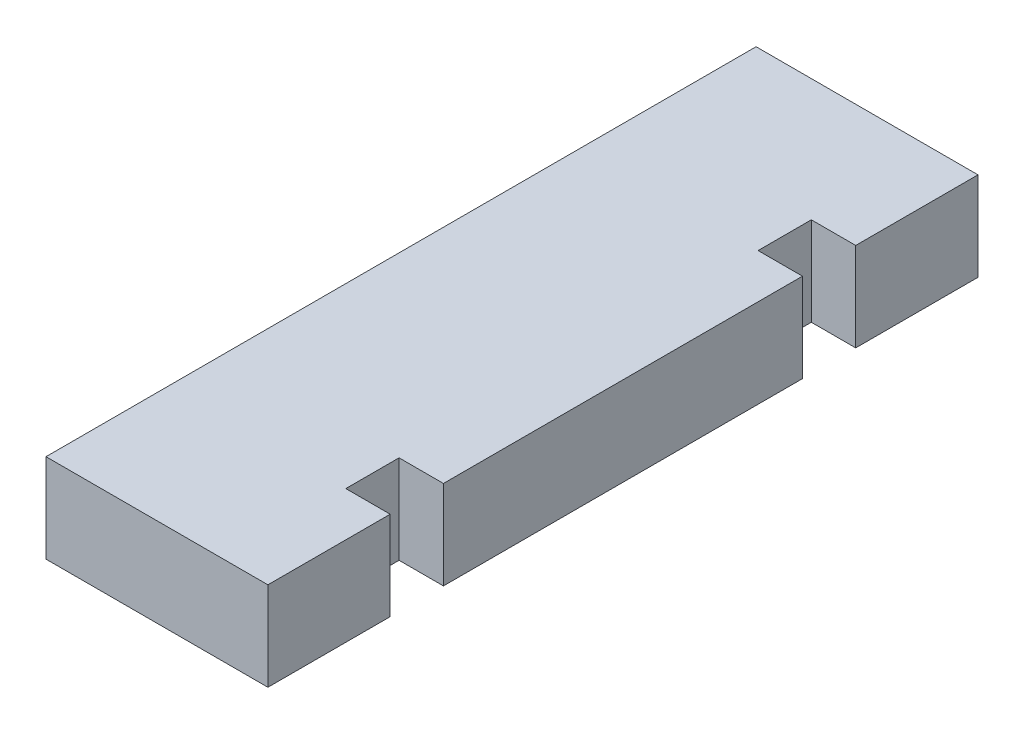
from build123d import *

# Parameters (mm, degrees)
ESQUISSE1_W             = 25
ESQUISSE1_H             = 10
EXTRUSION1_DEPTH        = 80
ESQUISSE9_W             = 6
ESQUISSE9_H             = 10
ENL_V_MAT_EXTRU_4_DEPTH = 5


with BuildPart() as part:
    # Esquisse1 → Extrusion1 (new body)
    with BuildSketch(Plane.XY):
        with Locations((12.5, 5)):
            Rectangle(ESQUISSE1_W, ESQUISSE1_H)
    extrude(amount=-EXTRUSION1_DEPTH)

    # Esquisse9 → Enl_v. mat.-Extru.4 (cut)
    with BuildSketch(Plane(origin=(25, 0, 0), x_dir=(0, 0, -1), z_dir=(1, 0, 0))):
        with Locations((16.776291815, 5)):
            Rectangle(ESQUISSE9_W, ESQUISSE9_H)
        with Locations((63.223708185, 5)):
            Rectangle(ESQUISSE9_W, ESQUISSE9_H)
    extrude(amount=-ENL_V_MAT_EXTRU_4_DEPTH, mode=Mode.SUBTRACT)


solid = part.part
